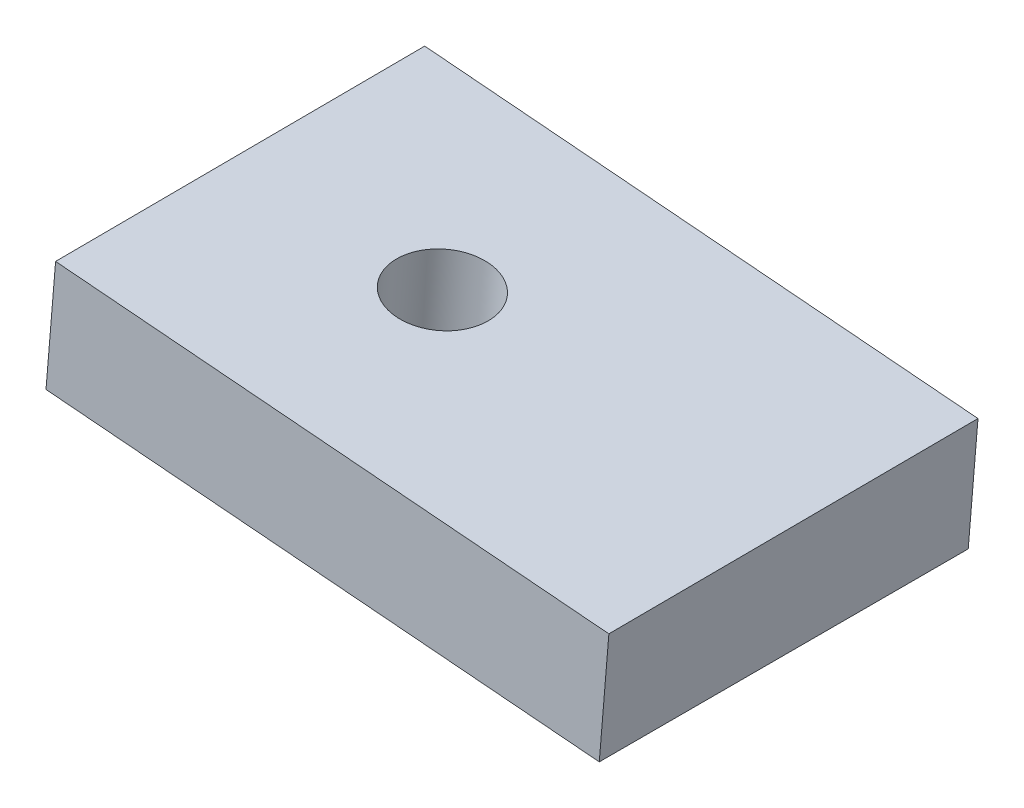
from build123d import *

# Parameters (mm, degrees)
SKETCH1_W                 = 15.047570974
SKETCH1_H                 = 10
BOSS_EXTRUDE1_DEPTH       = 3.203817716
DRAFT1_ANGLE              = -0.325763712
F_2_CLEARANCE_HOLE1_D     = 2.5
F_2_CLEARANCE_HOLE1_DEPTH = 4.421800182


with BuildPart() as part:
    # Sketch1 → Boss-Extrude1 (new body)
    with BuildSketch(Plane(origin=(-1.315367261, -15.86205167, 0), x_dir=(0.9965793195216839, -0.08264175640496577, 0), z_dir=(-0.08264175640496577, -0.9965793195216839, 0))):
        with Locations((-16.701480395, 5)):
            Rectangle(SKETCH1_W, SKETCH1_H)
    extrude(amount=-BOSS_EXTRUDE1_DEPTH)

    # Draft1
    draft1_faces = [part.faces().sort_by_distance(p)[0] for p in [
        (-17.694948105, -11.288953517, 5),
    ]]
    draft(draft1_faces, Plane(origin=(-25.192997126, -10.66717467, 0), x_dir=(-1, 0, 0), z_dir=(0, 0, -1)), DRAFT1_ANGLE)

    # 2 Clearance Hole1
    with Locations(Plane(origin=(-1.052360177, -12.690441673, 0), x_dir=(0.9965793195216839, -0.08264175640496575, 0), z_dir=(0.08264175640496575, 0.9965793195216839, 0))):
        with Locations((-18.725265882, -5)):
            Hole(F_2_CLEARANCE_HOLE1_D / 2, depth=F_2_CLEARANCE_HOLE1_DEPTH)


solid = part.part
